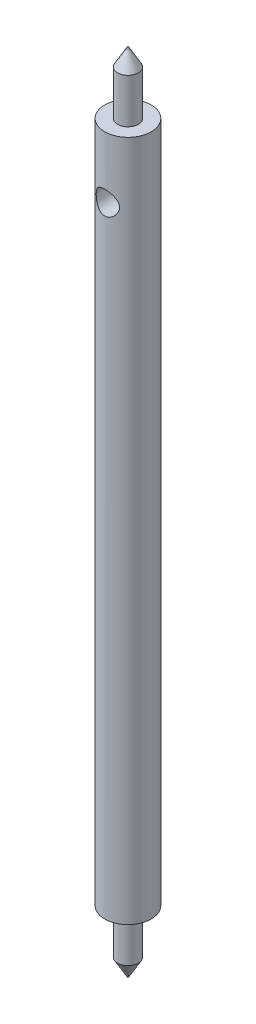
from build123d import *

# Parameters (mm, degrees)
SKETCH2_R               = 2.38125
BOSS_EXTRUDE1_DEPTH     = 69.85
SKETCH3_R               = 1.0668
BOSS_EXTRUDE2_DEPTH     = 4.572
BOSS_EXTRUDE3_START     = 4.572
SKETCH4_R               = 1.0668
BOSS_EXTRUDE3_DEPTH     = 4.572
CUT_EXTRUDE1_DEPTH      = 77.344061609
CUT_EXTRUDE1_DEPTH_BACK = 77.344061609
SKETCH11_R              = 1.190625


with BuildPart() as part:
    # Sketch2 → Boss-Extrude1 (new body)
    with BuildSketch(Plane(origin=(0, 0, 0), x_dir=(1, 0, 0), z_dir=(0, 1, 0))):
        with Locations(Location((0, 0, 0), (0, 0, 270))):
            Circle(SKETCH2_R)
    extrude(amount=BOSS_EXTRUDE1_DEPTH)

    # Sketch3 → Boss-Extrude2 (add)
    with BuildSketch(Plane(origin=(0, 69.85, 0), x_dir=(1, 0, 0), z_dir=(0, 1, 0))):
        with Locations(Location((0, 0, 0), (0, 0, 270))):
            Circle(SKETCH3_R)
    extrude(amount=BOSS_EXTRUDE2_DEPTH)

    # Sketch4 → Boss-Extrude3 (add)
    with BuildSketch(Plane.XZ.offset(BOSS_EXTRUDE3_START)):
        with Locations(Location((0, 0, 0), (0, 0, 90))):
            Circle(SKETCH4_R)
    extrude(amount=-BOSS_EXTRUDE3_DEPTH)

    # Sketch10 → Revolve3 (revolve)
    with BuildSketch(Plane.XY, mode=Mode.PRIVATE) as revolve3_sk:
        Polygon((1.0668, -4.572), (0, -6.419751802), (0, -4.572), align=None)
    revolve(revolve3_sk.sketch.rotate(Axis((0, 0, 0), (0, -1, 0)), 270), axis=Axis((0, 0, 0), (0, -1, 0)))

    # Sketch7 → Revolve4 (revolve)
    with BuildSketch(Plane.XY, mode=Mode.PRIVATE) as revolve4_sk:
        Polygon((0, 74.422), (-1.0668, 74.422), (0, 76.269751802), align=None)
    revolve(revolve4_sk.sketch.rotate(Axis((0, 74.422, 0), (0, 1, 0)), 270), axis=Axis((0, 74.422, 0), (0, 1, 0)))

    # Sketch11 → Cut-Extrude1 (cut, two sides: drawn at the far end of the back side and taken through both)
    with BuildSketch(Plane.XY.offset(-CUT_EXTRUDE1_DEPTH_BACK)):
        with Locations(Location((0, 63.569751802, 0), (0, 0, 90.00000001))):
            Circle(SKETCH11_R)
    extrude(amount=CUT_EXTRUDE1_DEPTH + CUT_EXTRUDE1_DEPTH_BACK, mode=Mode.SUBTRACT)


solid = part.part
